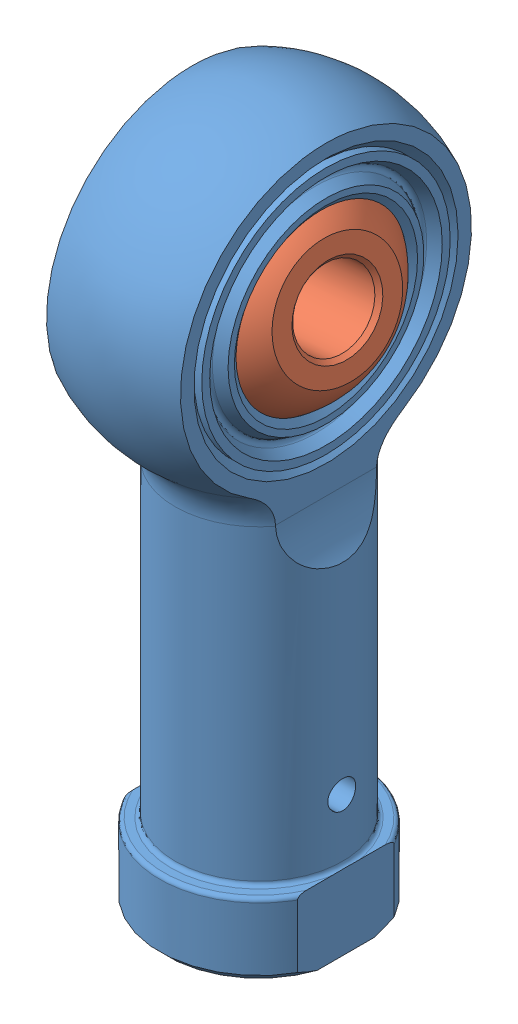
SolidWorks assembly ASx-xxT Female Rod End Imperial.SLDASM, configuration ASW-3T (file format 7000). Lengths in mm.
Overall size (14.11 45.16 20.47).
2 component instances, 2 part files, 1 mates.
Components (placement in the parent):
- ASx-xxT Female Rod End Imperial Body-2: ASx-xxT Female Rod End Imperial Body.SLDPRT [ASW-3T] at origin size (11.1 45.16 20.47)
- ASx-xxT Female Rod End Imperial Ball-2: ASx-xxT Female Rod End Imperial Ball.SLDPRT [ASW-3T] at (0 34.925 0) x (0.984066 0.158034 0.08148) z (-0.075627 -0.042712 0.996221) size (11.1 13.49 13.49)
Mates (geometry in assembly coordinates):
- Concentric1: concentric: sphere of ASx-xxT Female Rod End Imperial Body-2; sphere of ASx-xxT Female Rod End Imperial Ball-2
